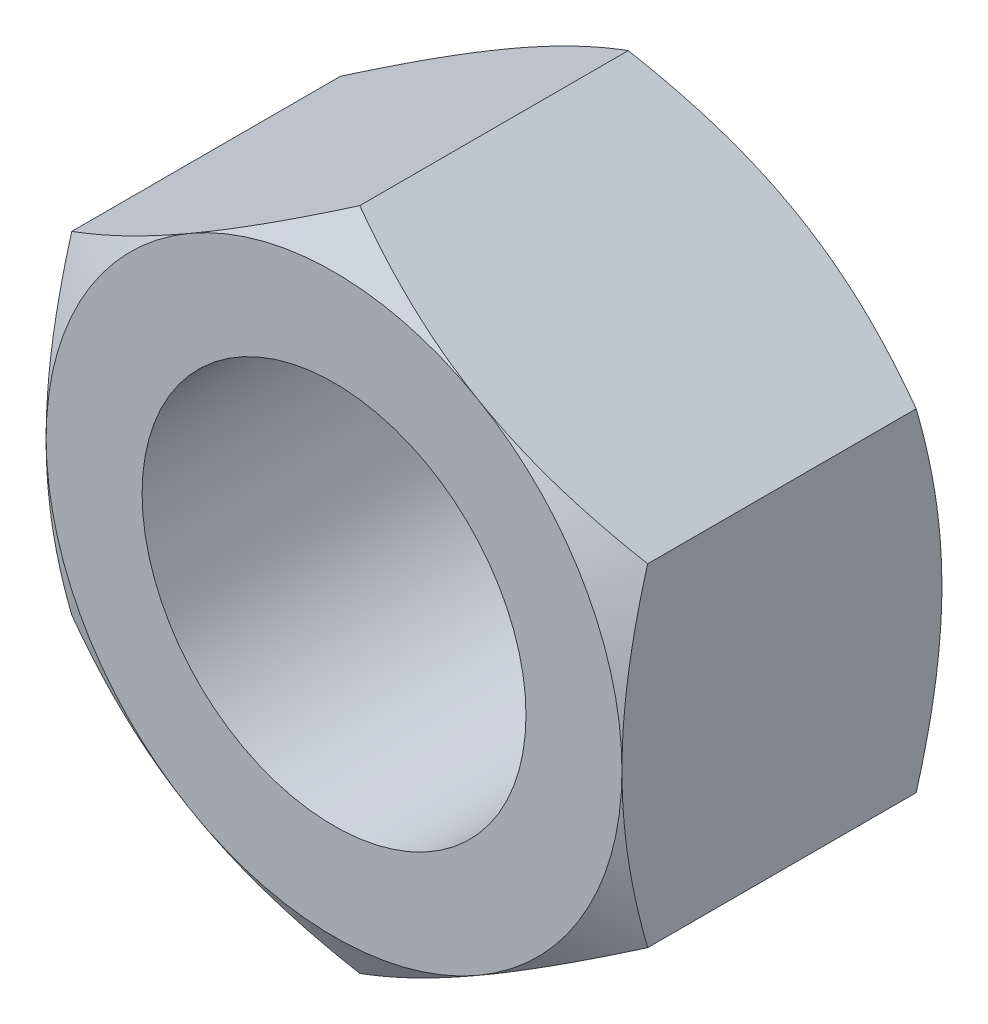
from build123d import *

# Parameters (mm, degrees)
BASE_EXTRUSION_DEPTH    = 10
ESQUISSE3_R             = 6
ENL_V_MAT_EXTRU_1_DEPTH = 18


with BuildPart() as part:
    # Esquisse1 → Base-Extrusion (new body)
    with BuildSketch(Plane.XY):
        Polygon((9, -5.196152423), (9, 5.196152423), (0, 10.392304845), (-9, 5.196152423), (-9, -5.196152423), (0, -10.392304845), align=None)
    extrude(amount=-BASE_EXTRUSION_DEPTH)

    # Esquisse2 → Enl_vement de mati_re-R_volution1 (revolve, cut)
    with BuildSketch(Plane(origin=(0, 0, 0), x_dir=(1, 0, 0), z_dir=(0, 1, 0)), mode=Mode.PRIVATE) as enl_vement_de_mati_re_r_volution1_sk:
        Polygon((-9, 0), (-18.660254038, 0), (-18.660254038, 10), (-9, 10), (-17.660254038, 5), align=None)
    revolve(enl_vement_de_mati_re_r_volution1_sk.sketch.rotate(Axis((0, 0, -10), (0, 0, 1)), 180), axis=Axis((0, 0, -10), (0, 0, 1)), mode=Mode.SUBTRACT)

    # Esquisse3 → Enl_v. mat.-Extru.1 (cut, through all)
    with BuildSketch(Plane.XY):
        Circle(ESQUISSE3_R)
    extrude(amount=-ENL_V_MAT_EXTRU_1_DEPTH, mode=Mode.SUBTRACT)


solid = part.part
